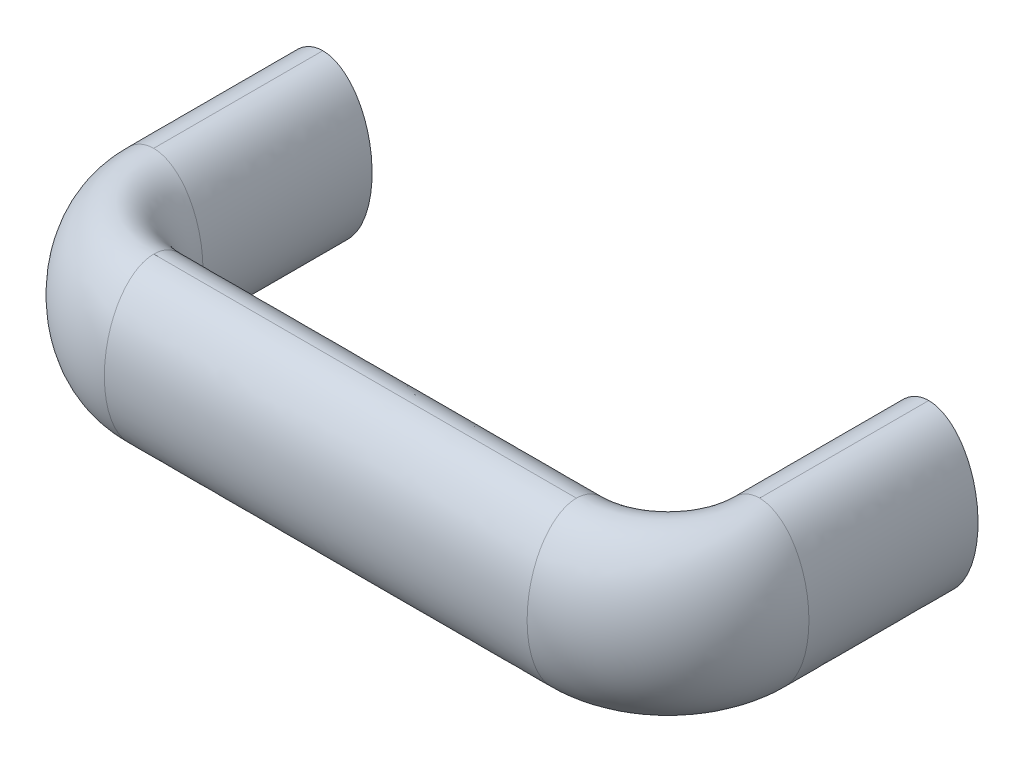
ISO-10303-21;
HEADER;
FILE_DESCRIPTION(('STEP AP214'),'2;1');
FILE_NAME('part.step','',(''),(''),'','','');
FILE_SCHEMA(('AUTOMOTIVE_DESIGN { 1 0 10303 214 1 1 1 1 }'));
ENDSEC;
DATA;
#1=APPLICATION_CONTEXT('core data for automotive mechanical design processes');
#2=APPLICATION_PROTOCOL_DEFINITION('international standard','automotive_design',2000,#1);
#3=PRODUCT_CONTEXT('',#1,'mechanical');
#4=PRODUCT('Part','Part','',(#3));
#5=PRODUCT_RELATED_PRODUCT_CATEGORY('part','',(#4));
#6=PRODUCT_DEFINITION_FORMATION('','',#4);
#7=PRODUCT_DEFINITION_CONTEXT('part definition',#1,'design');
#8=PRODUCT_DEFINITION('design','',#6,#7);
#9=PRODUCT_DEFINITION_SHAPE('','',#8);
#10=(LENGTH_UNIT() NAMED_UNIT(*) SI_UNIT(.MILLI.,.METRE.));
#11=(NAMED_UNIT(*) PLANE_ANGLE_UNIT() SI_UNIT($,.RADIAN.));
#12=(NAMED_UNIT(*) SI_UNIT($,.STERADIAN.) SOLID_ANGLE_UNIT());
#13=UNCERTAINTY_MEASURE_WITH_UNIT(LENGTH_MEASURE(1.E-05),#10,'distance_accuracy_value','');
#14=(GEOMETRIC_REPRESENTATION_CONTEXT(3) GLOBAL_UNCERTAINTY_ASSIGNED_CONTEXT((#13)) GLOBAL_UNIT_ASSIGNED_CONTEXT((#10,
#11,#12)) REPRESENTATION_CONTEXT('',''));
#15=CARTESIAN_POINT('',(0.,0.,0.));
#16=DIRECTION('',(0.,0.,1.));
#17=DIRECTION('',(1.,0.,0.));
#18=AXIS2_PLACEMENT_3D('',#15,#16,#17);
#19=CARTESIAN_POINT('',(82.953553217,-3.036,12.));
#20=DIRECTION('',(0.,0.,-1.));
#21=DIRECTION('',(0.,1.,0.));
#22=AXIS2_PLACEMENT_3D('',#19,#20,#21);
#23=PLANE('',#22);
#24=CARTESIAN_POINT('',(86.,0.,12.));
#25=DIRECTION('',(0.,0.,-1.));
#26=DIRECTION('',(0.,1.,0.));
#27=AXIS2_PLACEMENT_3D('',#24,#25,#26);
#28=CIRCLE('',#27,3.);
#29=CARTESIAN_POINT('',(86.,3.,12.));
#30=VERTEX_POINT('',#29);
#31=EDGE_CURVE('E18',#30,#30,#28,.T.);
#32=ORIENTED_EDGE('',*,*,#31,.T.);
#33=EDGE_LOOP('',(#32));
#34=FACE_BOUND('',#33,.T.);
#35=ADVANCED_FACE('F14',(#34),#23,.T.);
#36=CARTESIAN_POINT('',(86.,0.,12.));
#37=DIRECTION('',(0.,0.,-1.));
#38=DIRECTION('',(0.,1.,0.));
#39=AXIS2_PLACEMENT_3D('',#36,#37,#38);
#40=CYLINDRICAL_SURFACE('',#39,3.);
#41=ORIENTED_EDGE('',*,*,#31,.F.);
#42=EDGE_LOOP('',(#41));
#43=FACE_BOUND('',#42,.T.);
#44=CARTESIAN_POINT('',(86.,0.,0.));
#45=DIRECTION('',(0.,0.,-1.));
#46=DIRECTION('',(0.,1.,0.));
#47=AXIS2_PLACEMENT_3D('',#44,#45,#46);
#48=CIRCLE('',#47,3.);
#49=CARTESIAN_POINT('',(86.,3.,0.));
#50=VERTEX_POINT('',#49);
#51=EDGE_CURVE('E55',#50,#50,#48,.T.);
#52=ORIENTED_EDGE('',*,*,#51,.T.);
#53=EDGE_LOOP('',(#52));
#54=FACE_BOUND('',#53,.T.);
#55=ADVANCED_FACE('F305',(#43,#54),#40,.F.);
#56=CARTESIAN_POINT('',(78.856873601,11.638,0.));
#57=DIRECTION('',(0.,0.,1.));
#58=DIRECTION('',(0.,-1.,0.));
#59=AXIS2_PLACEMENT_3D('',#56,#57,#58);
#60=PLANE('',#59);
#61=ORIENTED_EDGE('',*,*,#51,.F.);
#62=EDGE_LOOP('',(#61));
#63=FACE_BOUND('',#62,.T.);
#64=CARTESIAN_POINT('',(86.,-11.5,0.));
#65=CARTESIAN_POINT('',(85.9351054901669,-11.5000015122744,0.));
#66=CARTESIAN_POINT('',(85.8702202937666,-11.4985170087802,0.));
#67=CARTESIAN_POINT('',(85.7405889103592,-11.4925940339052,0.));
#68=CARTESIAN_POINT('',(85.6758427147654,-11.4881557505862,0.));
#69=CARTESIAN_POINT('',(85.4821151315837,-11.4704493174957,0.));
#70=CARTESIAN_POINT('',(85.3535093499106,-11.452789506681,0.));
#71=CARTESIAN_POINT('',(85.099489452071,-11.4063611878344,0.));
#72=CARTESIAN_POINT('',(84.9740574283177,-11.3776891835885,0.));
#73=CARTESIAN_POINT('',(84.726056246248,-11.3098362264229,0.));
#74=CARTESIAN_POINT('',(84.6034875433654,-11.2706536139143,0.));
#75=CARTESIAN_POINT('',(84.3623261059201,-11.182685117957,0.));
#76=CARTESIAN_POINT('',(84.2437214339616,-11.133931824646,0.));
#77=CARTESIAN_POINT('',(84.0105356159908,-11.0275600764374,0.));
#78=CARTESIAN_POINT('',(83.8959558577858,-10.9699385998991,0.));
#79=CARTESIAN_POINT('',(83.5584536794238,-10.7848457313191,0.));
#80=CARTESIAN_POINT('',(83.3421210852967,-10.6452785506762,0.));
#81=CARTESIAN_POINT('',(82.805492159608,-10.2498914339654,0.));
#82=CARTESIAN_POINT('',(82.4997960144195,-9.97426969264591,0.));
#83=CARTESIAN_POINT('',(82.0767405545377,-9.52804217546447,0.));
#84=CARTESIAN_POINT('',(81.9414500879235,-9.37356190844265,0.));
#85=CARTESIAN_POINT('',(81.6820982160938,-9.05538951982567,0.));
#86=CARTESIAN_POINT('',(81.5580364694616,-8.8916976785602,0.));
#87=CARTESIAN_POINT('',(81.2530223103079,-8.46136533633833,0.));
#88=CARTESIAN_POINT('',(81.0798986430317,-8.18917689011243,0.));
#89=CARTESIAN_POINT('',(80.7578400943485,-7.63081626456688,0.));
#90=CARTESIAN_POINT('',(80.6089188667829,-7.34463630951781,0.));
#91=CARTESIAN_POINT('',(80.3332533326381,-6.76141809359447,0.));
#92=CARTESIAN_POINT('',(80.20653642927,-6.46436695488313,0.));
#93=CARTESIAN_POINT('',(79.973907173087,-5.86232711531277,0.));
#94=CARTESIAN_POINT('',(79.867993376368,-5.55733896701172,0.));
#95=CARTESIAN_POINT('',(79.6273940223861,-4.78690573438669,0.));
#96=CARTESIAN_POINT('',(79.5048832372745,-4.31763335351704,0.));
#97=CARTESIAN_POINT('',(79.3003681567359,-3.37027269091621,0.));
#98=CARTESIAN_POINT('',(79.2183837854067,-2.89218019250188,0.));
#99=CARTESIAN_POINT('',(79.0927829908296,-1.9300589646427,0.));
#100=CARTESIAN_POINT('',(79.049242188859,-1.44602042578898,0.));
#101=CARTESIAN_POINT('',(78.9997341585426,-0.476149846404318,0.));
#102=CARTESIAN_POINT('',(78.9937595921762,0.00968182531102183,0.));
#103=CARTESIAN_POINT('',(79.019544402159,0.992855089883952,0.));
#104=CARTESIAN_POINT('',(79.0522765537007,1.49017193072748,0.));
#105=CARTESIAN_POINT('',(79.157949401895,2.48069630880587,0.));
#106=CARTESIAN_POINT('',(79.2309032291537,2.97390245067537,0.));
#107=CARTESIAN_POINT('',(79.4186937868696,3.95084095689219,0.));
#108=CARTESIAN_POINT('',(79.533396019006,4.43459854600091,0.));
#109=CARTESIAN_POINT('',(79.7391698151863,5.15022437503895,0.));
#110=CARTESIAN_POINT('',(79.8133542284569,5.38702931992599,0.));
#111=CARTESIAN_POINT('',(79.9735434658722,5.85666049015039,0.));
#112=CARTESIAN_POINT('',(80.0595492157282,6.08948640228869,0.));
#113=CARTESIAN_POINT('',(80.2435826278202,6.54912324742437,0.));
#114=CARTESIAN_POINT('',(80.3415538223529,6.77595672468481,0.));
#115=CARTESIAN_POINT('',(80.5505344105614,7.22348981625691,0.));
#116=CARTESIAN_POINT('',(80.6615402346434,7.44419108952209,0.));
#117=CARTESIAN_POINT('',(80.8974331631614,7.87803594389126,0.));
#118=CARTESIAN_POINT('',(81.022318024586,8.09118073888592,0.));
#119=CARTESIAN_POINT('',(81.2869002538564,8.50807984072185,0.));
#120=CARTESIAN_POINT('',(81.4265949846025,8.7118358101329,0.));
#121=CARTESIAN_POINT('',(81.6919607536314,9.06760121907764,0.));
#122=CARTESIAN_POINT('',(81.8147584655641,9.22174506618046,0.));
#123=CARTESIAN_POINT('',(82.0708542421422,9.52099560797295,0.));
#124=CARTESIAN_POINT('',(82.2041528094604,9.66610186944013,0.));
#125=CARTESIAN_POINT('',(82.6202006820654,10.084864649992,0.));
#126=CARTESIAN_POINT('',(82.9196457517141,10.3427161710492,0.));
#127=CARTESIAN_POINT('',(83.4698019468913,10.7302249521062,0.));
#128=CARTESIAN_POINT('',(83.7095108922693,10.8753814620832,0.));
#129=CARTESIAN_POINT('',(84.0838086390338,11.0628126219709,0.));
#130=CARTESIAN_POINT('',(84.2109030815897,11.1201990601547,0.));
#131=CARTESIAN_POINT('',(84.4695509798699,11.2239031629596,0.));
#132=CARTESIAN_POINT('',(84.6011035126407,11.2702231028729,0.));
#133=CARTESIAN_POINT('',(84.836637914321,11.3413545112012,0.));
#134=CARTESIAN_POINT('',(84.9398716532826,11.3686626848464,0.));
#135=CARTESIAN_POINT('',(85.1480188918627,11.415807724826,0.));
#136=CARTESIAN_POINT('',(85.2529320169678,11.4356462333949,0.));
#137=CARTESIAN_POINT('',(85.4645320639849,11.4676385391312,0.));
#138=CARTESIAN_POINT('',(85.5712256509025,11.4797483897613,0.));
#139=CARTESIAN_POINT('',(85.7852760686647,11.4959426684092,0.));
#140=CARTESIAN_POINT('',(85.8926332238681,11.5000227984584,0.));
#141=CARTESIAN_POINT('',(86.,11.5,0.));
#142=B_SPLINE_CURVE_WITH_KNOTS('',3,(#64,#65,#66,#67,#68,#69,#70,#71,#72,#73,#74,#75,#76,#77,
#78,#79,#80,#81,#82,#83,#84,#85,#86,#87,#88,#89,#90,#91,#92,#93,#94,#95,#96,#97,#98,#99,#100,
#101,#102,#103,#104,#105,#106,#107,#108,#109,#110,#111,#112,#113,#114,#115,#116,#117,#118,#119,
#120,#121,#122,#123,#124,#125,#126,#127,#128,#129,#130,#131,#132,#133,#134,#135,#136,#137,#138,
#139,#140,#141),.UNSPECIFIED.,.F.,.F.,(4,2,2,2,2,2,2,2,2,2,2,2,2,2,2,2,2,2,2,2,2,2,2,2,2,2,2,2,
2,2,2,2,2,2,2,2,2,2,4),(0.,0.194648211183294,0.389284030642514,0.778150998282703,
1.16368519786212,1.54928030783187,1.93358447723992,2.31801988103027,3.08800997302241,
4.31549852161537,4.93120446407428,5.54689167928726,6.51314712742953,7.47994581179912,
8.44792938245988,9.415845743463,10.8687502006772,12.3223682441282,13.7788393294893,
15.2350259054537,16.7286007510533,18.2226634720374,19.7119548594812,20.4561603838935,
21.2004242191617,21.941302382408,22.6819781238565,23.4225343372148,24.162958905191,
24.7537128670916,25.3444951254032,26.5233036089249,27.3607138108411,27.7786288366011,
28.196457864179,28.5165594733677,28.83659066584,29.158425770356,29.480433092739),.UNSPECIFIED.);
#143=CARTESIAN_POINT('',(86.,-11.5,0.));
#144=VERTEX_POINT('',#143);
#145=CARTESIAN_POINT('',(86.,11.5,0.));
#146=VERTEX_POINT('',#145);
#147=EDGE_CURVE('E53',#144,#146,#142,.T.);
#148=ORIENTED_EDGE('',*,*,#147,.T.);
#149=CARTESIAN_POINT('',(86.,11.5,0.));
#150=CARTESIAN_POINT('',(86.0648945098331,11.5000015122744,0.));
#151=CARTESIAN_POINT('',(86.1297797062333,11.4985170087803,0.));
#152=CARTESIAN_POINT('',(86.2594110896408,11.4925940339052,0.));
#153=CARTESIAN_POINT('',(86.3241572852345,11.4881557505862,0.));
#154=CARTESIAN_POINT('',(86.5178848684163,11.4704493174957,0.));
#155=CARTESIAN_POINT('',(86.6464906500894,11.452789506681,0.));
#156=CARTESIAN_POINT('',(86.9005105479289,11.4063611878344,0.));
#157=CARTESIAN_POINT('',(87.0259425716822,11.3776891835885,0.));
#158=CARTESIAN_POINT('',(87.2739437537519,11.3098362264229,0.));
#159=CARTESIAN_POINT('',(87.3965124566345,11.2706536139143,0.));
#160=CARTESIAN_POINT('',(87.6376738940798,11.182685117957,0.));
#161=CARTESIAN_POINT('',(87.7562785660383,11.1339318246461,0.));
#162=CARTESIAN_POINT('',(87.9894643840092,11.0275600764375,0.));
#163=CARTESIAN_POINT('',(88.1040441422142,10.9699385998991,0.));
#164=CARTESIAN_POINT('',(88.4415463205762,10.7848457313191,0.));
#165=CARTESIAN_POINT('',(88.6578789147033,10.6452785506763,0.));
#166=CARTESIAN_POINT('',(89.194507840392,10.2498914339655,0.));
#167=CARTESIAN_POINT('',(89.5002039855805,9.97426969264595,0.));
#168=CARTESIAN_POINT('',(89.9232594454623,9.52804217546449,0.));
#169=CARTESIAN_POINT('',(90.0585499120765,9.37356190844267,0.));
#170=CARTESIAN_POINT('',(90.3179017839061,9.05538951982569,0.));
#171=CARTESIAN_POINT('',(90.4419635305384,8.89169767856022,0.));
#172=CARTESIAN_POINT('',(90.7469776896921,8.46136533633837,0.));
#173=CARTESIAN_POINT('',(90.9201013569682,8.18917689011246,0.));
#174=CARTESIAN_POINT('',(91.2421599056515,7.6308162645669,0.));
#175=CARTESIAN_POINT('',(91.3910811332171,7.34463630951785,0.));
#176=CARTESIAN_POINT('',(91.6667466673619,6.76141809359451,0.));
#177=CARTESIAN_POINT('',(91.79346357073,6.46436695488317,0.));
#178=CARTESIAN_POINT('',(92.026092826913,5.86232711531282,0.));
#179=CARTESIAN_POINT('',(92.132006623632,5.55733896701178,0.));
#180=CARTESIAN_POINT('',(92.3726059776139,4.78690573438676,0.));
#181=CARTESIAN_POINT('',(92.4951167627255,4.31763335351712,0.));
#182=CARTESIAN_POINT('',(92.699631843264,3.37027269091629,0.));
#183=CARTESIAN_POINT('',(92.7816162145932,2.89218019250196,0.));
#184=CARTESIAN_POINT('',(92.9072170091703,1.93005896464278,0.));
#185=CARTESIAN_POINT('',(92.950757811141,1.44602042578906,0.));
#186=CARTESIAN_POINT('',(93.0002658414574,0.476149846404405,0.));
#187=CARTESIAN_POINT('',(93.0062404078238,-0.00968182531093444,0.));
#188=CARTESIAN_POINT('',(92.9804555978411,-0.992855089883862,0.));
#189=CARTESIAN_POINT('',(92.9477234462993,-1.49017193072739,0.));
#190=CARTESIAN_POINT('',(92.8420505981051,-2.48069630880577,0.));
#191=CARTESIAN_POINT('',(92.7690967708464,-2.97390245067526,0.));
#192=CARTESIAN_POINT('',(92.5813062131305,-3.95084095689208,0.));
#193=CARTESIAN_POINT('',(92.4666039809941,-4.43459854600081,0.));
#194=CARTESIAN_POINT('',(92.2608301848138,-5.15022437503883,0.));
#195=CARTESIAN_POINT('',(92.1866457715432,-5.38702931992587,0.));
#196=CARTESIAN_POINT('',(92.0264565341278,-5.85666049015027,0.));
#197=CARTESIAN_POINT('',(91.9404507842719,-6.08948640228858,0.));
#198=CARTESIAN_POINT('',(91.7564173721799,-6.54912324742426,0.));
#199=CARTESIAN_POINT('',(91.6584461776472,-6.7759567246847,0.));
#200=CARTESIAN_POINT('',(91.4494655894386,-7.22348981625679,0.));
#201=CARTESIAN_POINT('',(91.3384597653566,-7.44419108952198,0.));
#202=CARTESIAN_POINT('',(91.1025668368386,-7.87803594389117,0.));
#203=CARTESIAN_POINT('',(90.9776819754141,-8.09118073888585,0.));
#204=CARTESIAN_POINT('',(90.7130997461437,-8.50807984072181,0.));
#205=CARTESIAN_POINT('',(90.5734050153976,-8.71183581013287,0.));
#206=CARTESIAN_POINT('',(90.3080392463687,-9.06760121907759,0.));
#207=CARTESIAN_POINT('',(90.185241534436,-9.22174506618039,0.));
#208=CARTESIAN_POINT('',(89.9291457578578,-9.52099560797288,0.));
#209=CARTESIAN_POINT('',(89.7958471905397,-9.66610186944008,0.));
#210=CARTESIAN_POINT('',(89.3797993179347,-10.084864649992,0.));
#211=CARTESIAN_POINT('',(89.0803542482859,-10.3427161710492,0.));
#212=CARTESIAN_POINT('',(88.5301980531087,-10.7302249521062,0.));
#213=CARTESIAN_POINT('',(88.2904891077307,-10.8753814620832,0.));
#214=CARTESIAN_POINT('',(87.9161913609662,-11.0628126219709,0.));
#215=CARTESIAN_POINT('',(87.7890969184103,-11.1201990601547,0.));
#216=CARTESIAN_POINT('',(87.5304490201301,-11.2239031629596,0.));
#217=CARTESIAN_POINT('',(87.3988964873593,-11.2702231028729,0.));
#218=CARTESIAN_POINT('',(87.163362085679,-11.3413545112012,0.));
#219=CARTESIAN_POINT('',(87.0601283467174,-11.3686626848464,0.));
#220=CARTESIAN_POINT('',(86.8519811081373,-11.415807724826,0.));
#221=CARTESIAN_POINT('',(86.7470679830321,-11.4356462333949,0.));
#222=CARTESIAN_POINT('',(86.5354679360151,-11.4676385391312,0.));
#223=CARTESIAN_POINT('',(86.4287743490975,-11.4797483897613,0.));
#224=CARTESIAN_POINT('',(86.2147239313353,-11.4959426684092,0.));
#225=CARTESIAN_POINT('',(86.1073667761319,-11.5000227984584,0.));
#226=CARTESIAN_POINT('',(86.,-11.5,0.));
#227=B_SPLINE_CURVE_WITH_KNOTS('',3,(#149,#150,#151,#152,#153,#154,#155,#156,#157,#158,#159,
#160,#161,#162,#163,#164,#165,#166,#167,#168,#169,#170,#171,#172,#173,#174,#175,#176,#177,#178,
#179,#180,#181,#182,#183,#184,#185,#186,#187,#188,#189,#190,#191,#192,#193,#194,#195,#196,#197,
#198,#199,#200,#201,#202,#203,#204,#205,#206,#207,#208,#209,#210,#211,#212,#213,#214,#215,#216,
#217,#218,#219,#220,#221,#222,#223,#224,#225,#226),.UNSPECIFIED.,.F.,.F.,(4,2,2,2,2,2,2,2,2,2,2,
2,2,2,2,2,2,2,2,2,2,2,2,2,2,2,2,2,2,2,2,2,2,2,2,2,2,2,4),(0.,0.19464821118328,0.389284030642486,
0.778150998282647,1.16368519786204,1.5492803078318,1.93358447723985,2.31801988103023,
3.0880099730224,4.31549852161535,4.93120446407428,5.54689167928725,6.51314712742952,
7.4799458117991,8.44792938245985,9.41584574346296,10.8687502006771,12.3223682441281,
13.7788393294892,15.2350259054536,16.7286007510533,18.2226634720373,19.7119548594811,
20.4561603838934,21.2004242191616,21.9413023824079,22.6819781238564,23.4225343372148,
24.162958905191,24.7537128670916,25.3444951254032,26.5233036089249,27.3607138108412,
27.7786288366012,28.1964578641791,28.5165594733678,28.8365906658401,29.158425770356,
29.4804330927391),.UNSPECIFIED.);
#228=EDGE_CURVE('E45',#146,#144,#227,.T.);
#229=ORIENTED_EDGE('',*,*,#228,.T.);
#230=EDGE_LOOP('',(#148,#229));
#231=FACE_BOUND('',#230,.T.);
#232=ADVANCED_FACE('F52',(#63,#231),#60,.F.);
#233=CARTESIAN_POINT('',(86.,-11.5,24.));
#234=CARTESIAN_POINT('',(86.,-11.5,16.));
#235=CARTESIAN_POINT('',(86.,-11.5,8.));
#236=CARTESIAN_POINT('',(86.,-11.5,0.));
#237=CARTESIAN_POINT('',(100.,-11.5,24.));
#238=CARTESIAN_POINT('',(100.,-11.5,16.));
#239=CARTESIAN_POINT('',(100.,-11.5,8.));
#240=CARTESIAN_POINT('',(100.,-11.5,0.));
#241=CARTESIAN_POINT('',(100.,11.5,24.));
#242=CARTESIAN_POINT('',(100.,11.5,16.));
#243=CARTESIAN_POINT('',(100.,11.5,8.));
#244=CARTESIAN_POINT('',(100.,11.5,0.));
#245=CARTESIAN_POINT('',(86.,11.5,24.));
#246=CARTESIAN_POINT('',(86.,11.5,16.));
#247=CARTESIAN_POINT('',(86.,11.5,8.));
#248=CARTESIAN_POINT('',(86.,11.5,0.));
#249=(BOUNDED_SURFACE() B_SPLINE_SURFACE(3,3,((#233,#234,#235,#236),(#237,#238,#239,#240),(#241,
#242,#243,#244),(#245,#246,#247,#248)),.UNSPECIFIED.,.F.,.F.,
.F.) B_SPLINE_SURFACE_WITH_KNOTS((4,4),(4,4),(0.,1.),(0.,1.),
.UNSPECIFIED.) GEOMETRIC_REPRESENTATION_ITEM() RATIONAL_B_SPLINE_SURFACE(((1.,1.,1.,1.),
(0.333333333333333,0.333333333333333,0.333333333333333,0.333333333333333),(0.333333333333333,
0.333333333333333,0.333333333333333,0.333333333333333),(1.,1.,1.,1.))) REPRESENTATION_ITEM('') SURFACE());
#250=CARTESIAN_POINT('',(86.,-11.5,24.));
#251=CARTESIAN_POINT('',(100.,-11.5,24.));
#252=CARTESIAN_POINT('',(100.,11.5,24.));
#253=CARTESIAN_POINT('',(86.,11.5,24.));
#254=CARTESIAN_POINT('',(72.0000000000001,11.5,24.));
#255=CARTESIAN_POINT('',(72.0000000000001,-11.5,24.));
#256=CARTESIAN_POINT('',(86.,-11.5,24.));
#257=(BOUNDED_CURVE() B_SPLINE_CURVE(3,(#250,#251,#252,#253,#254,#255,#256),.UNSPECIFIED.,.T.,
.F.) B_SPLINE_CURVE_WITH_KNOTS((4,3,4),(0.,0.5,1.),
.UNSPECIFIED.) CURVE() GEOMETRIC_REPRESENTATION_ITEM() RATIONAL_B_SPLINE_CURVE((1.,
0.333333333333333,0.333333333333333,1.,0.333333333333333,0.333333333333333,1.)) REPRESENTATION_ITEM(''));
#258=CARTESIAN_POINT('',(86.,-11.5,24.));
#259=VERTEX_POINT('',#258);
#260=CARTESIAN_POINT('',(86.,11.5,24.));
#261=VERTEX_POINT('',#260);
#262=EDGE_CURVE('E66',#259,#261,#257,.T.);
#263=DIRECTION('',(0.,0.,-1.));
#264=VECTOR('',#263,1.);
#265=CARTESIAN_POINT('',(86.,-11.5,12.));
#266=LINE('',#265,#264);
#267=EDGE_CURVE('E54',#259,#144,#266,.T.);
#268=DIRECTION('',(0.,0.,1.));
#269=VECTOR('',#268,1.);
#270=CARTESIAN_POINT('',(86.,11.5,12.));
#271=LINE('',#270,#269);
#272=EDGE_CURVE('E61',#146,#261,#271,.T.);
#273=ORIENTED_EDGE('',*,*,#262,.F.);
#274=ORIENTED_EDGE('',*,*,#267,.T.);
#275=ORIENTED_EDGE('',*,*,#228,.F.);
#276=ORIENTED_EDGE('',*,*,#272,.T.);
#277=EDGE_LOOP('',(#273,#274,#275,#276));
#278=FACE_BOUND('',#277,.T.);
#279=ADVANCED_FACE('F64',(#278),#249,.F.);
#280=CARTESIAN_POINT('',(86.,11.5,24.));
#281=CARTESIAN_POINT('',(86.,11.5,16.));
#282=CARTESIAN_POINT('',(86.,11.5,8.));
#283=CARTESIAN_POINT('',(86.,11.5,0.));
#284=CARTESIAN_POINT('',(72.0000000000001,11.5,24.));
#285=CARTESIAN_POINT('',(72.0000000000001,11.5,16.));
#286=CARTESIAN_POINT('',(72.0000000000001,11.5,8.));
#287=CARTESIAN_POINT('',(72.0000000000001,11.5,0.));
#288=CARTESIAN_POINT('',(72.0000000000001,-11.5,24.));
#289=CARTESIAN_POINT('',(72.0000000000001,-11.5,16.));
#290=CARTESIAN_POINT('',(72.0000000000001,-11.5,8.));
#291=CARTESIAN_POINT('',(72.0000000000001,-11.5,0.));
#292=CARTESIAN_POINT('',(86.,-11.5,24.));
#293=CARTESIAN_POINT('',(86.,-11.5,16.));
#294=CARTESIAN_POINT('',(86.,-11.5,8.));
#295=CARTESIAN_POINT('',(86.,-11.5,0.));
#296=(BOUNDED_SURFACE() B_SPLINE_SURFACE(3,3,((#280,#281,#282,#283),(#284,#285,#286,#287),(#288,
#289,#290,#291),(#292,#293,#294,#295)),.UNSPECIFIED.,.F.,.F.,
.F.) B_SPLINE_SURFACE_WITH_KNOTS((4,4),(4,4),(0.,1.),(0.,1.),
.UNSPECIFIED.) GEOMETRIC_REPRESENTATION_ITEM() RATIONAL_B_SPLINE_SURFACE(((1.,1.,1.,1.),
(0.333333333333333,0.333333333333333,0.333333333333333,0.333333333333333),(0.333333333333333,
0.333333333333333,0.333333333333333,0.333333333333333),(1.,1.,1.,1.))) REPRESENTATION_ITEM('') SURFACE());
#297=CARTESIAN_POINT('',(86.,-11.5,24.));
#298=CARTESIAN_POINT('',(100.,-11.5,24.));
#299=CARTESIAN_POINT('',(100.,11.5,24.));
#300=CARTESIAN_POINT('',(86.,11.5,24.));
#301=CARTESIAN_POINT('',(72.0000000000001,11.5,24.));
#302=CARTESIAN_POINT('',(72.0000000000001,-11.5,24.));
#303=CARTESIAN_POINT('',(86.,-11.5,24.));
#304=(BOUNDED_CURVE() B_SPLINE_CURVE(3,(#297,#298,#299,#300,#301,#302,#303),.UNSPECIFIED.,.T.,
.F.) B_SPLINE_CURVE_WITH_KNOTS((4,3,4),(0.,0.5,1.),
.UNSPECIFIED.) CURVE() GEOMETRIC_REPRESENTATION_ITEM() RATIONAL_B_SPLINE_CURVE((1.,
0.333333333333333,0.333333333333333,1.,0.333333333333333,0.333333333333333,1.)) REPRESENTATION_ITEM(''));
#305=EDGE_CURVE('E128',#261,#259,#304,.T.);
#306=ORIENTED_EDGE('',*,*,#272,.F.);
#307=ORIENTED_EDGE('',*,*,#147,.F.);
#308=ORIENTED_EDGE('',*,*,#267,.F.);
#309=ORIENTED_EDGE('',*,*,#305,.F.);
#310=EDGE_LOOP('',(#306,#307,#308,#309));
#311=FACE_BOUND('',#310,.T.);
#312=ADVANCED_FACE('F58',(#311),#296,.F.);
#313=CARTESIAN_POINT('',(86.,-11.5,24.));
#314=CARTESIAN_POINT('',(86.,-11.5,31.615223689));
#315=CARTESIAN_POINT('',(80.6152236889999,-11.5,37.));
#316=CARTESIAN_POINT('',(73.,-11.5,37.));
#317=CARTESIAN_POINT('',(100.,-11.5,24.));
#318=CARTESIAN_POINT('',(100.,-11.5,39.816233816));
#319=CARTESIAN_POINT('',(88.8162338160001,-11.5,51.));
#320=CARTESIAN_POINT('',(73.,-11.5,51.0000000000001));
#321=CARTESIAN_POINT('',(100.,11.5,24.));
#322=CARTESIAN_POINT('',(100.,11.5,39.816233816));
#323=CARTESIAN_POINT('',(88.8162338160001,11.5,51.));
#324=CARTESIAN_POINT('',(73.,11.5,51.0000000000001));
#325=CARTESIAN_POINT('',(86.,11.5,24.));
#326=CARTESIAN_POINT('',(86.,11.5,31.615223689));
#327=CARTESIAN_POINT('',(80.6152236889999,11.5,37.));
#328=CARTESIAN_POINT('',(73.,11.5,37.));
#329=CARTESIAN_POINT('',(72.0000000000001,11.5,24.));
#330=CARTESIAN_POINT('',(72.0000000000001,11.5,23.414213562));
#331=CARTESIAN_POINT('',(72.414213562,11.5,23.));
#332=CARTESIAN_POINT('',(73.,11.5,23.));
#333=CARTESIAN_POINT('',(72.0000000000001,-11.5,24.));
#334=CARTESIAN_POINT('',(72.0000000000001,-11.5,23.414213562));
#335=CARTESIAN_POINT('',(72.414213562,-11.5,23.));
#336=CARTESIAN_POINT('',(73.,-11.5,23.));
#337=CARTESIAN_POINT('',(86.,-11.5,24.));
#338=CARTESIAN_POINT('',(86.,-11.5,31.615223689));
#339=CARTESIAN_POINT('',(80.6152236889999,-11.5,37.));
#340=CARTESIAN_POINT('',(73.,-11.5,37.));
#341=(BOUNDED_SURFACE() B_SPLINE_SURFACE(3,3,((#313,#314,#315,#316),(#317,#318,#319,#320),(#321,
#322,#323,#324),(#325,#326,#327,#328),(#329,#330,#331,#332),(#333,#334,#335,#336),(#337,#338,
#339,#340)),.UNSPECIFIED.,.T.,.F.,.F.) B_SPLINE_SURFACE_WITH_KNOTS((4,3,4),(4,4),(0.,0.5,1.),
(0.,1.),.UNSPECIFIED.) GEOMETRIC_REPRESENTATION_ITEM() RATIONAL_B_SPLINE_SURFACE(((1.,
0.804737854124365,0.804737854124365,1.),(0.333333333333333,0.268245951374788,0.268245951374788,
0.333333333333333),(0.333333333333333,0.268245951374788,0.268245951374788,0.333333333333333),
(1.,0.804737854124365,0.804737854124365,1.),(0.333333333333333,0.268245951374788,
0.268245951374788,0.333333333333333),(0.333333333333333,0.268245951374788,0.268245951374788,
0.333333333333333),(1.,0.804737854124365,0.804737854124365,1.))) REPRESENTATION_ITEM('') SURFACE());
#342=CARTESIAN_POINT('',(73.,-11.5,37.));
#343=CARTESIAN_POINT('',(73.,-11.5,51.0000000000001));
#344=CARTESIAN_POINT('',(73.,11.5,51.0000000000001));
#345=CARTESIAN_POINT('',(73.,11.5,37.));
#346=(BOUNDED_CURVE() B_SPLINE_CURVE(3,(#342,#343,#344,#345),.UNSPECIFIED.,.F.,
.F.) B_SPLINE_CURVE_WITH_KNOTS((4,4),(0.,1.),
.UNSPECIFIED.) CURVE() GEOMETRIC_REPRESENTATION_ITEM() RATIONAL_B_SPLINE_CURVE((1.,
0.333333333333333,0.333333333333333,1.)) REPRESENTATION_ITEM(''));
#347=CARTESIAN_POINT('',(73.,-11.5,37.));
#348=VERTEX_POINT('',#347);
#349=CARTESIAN_POINT('',(73.,11.5,37.));
#350=VERTEX_POINT('',#349);
#351=EDGE_CURVE('E145',#348,#350,#346,.T.);
#352=CARTESIAN_POINT('',(73.,11.5,37.));
#353=CARTESIAN_POINT('',(73.,11.5,23.));
#354=CARTESIAN_POINT('',(73.,-11.5,23.));
#355=CARTESIAN_POINT('',(73.,-11.5,37.));
#356=(BOUNDED_CURVE() B_SPLINE_CURVE(3,(#352,#353,#354,#355),.UNSPECIFIED.,.F.,
.F.) B_SPLINE_CURVE_WITH_KNOTS((4,4),(0.,1.),
.UNSPECIFIED.) CURVE() GEOMETRIC_REPRESENTATION_ITEM() RATIONAL_B_SPLINE_CURVE((1.,
0.333333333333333,0.333333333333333,1.)) REPRESENTATION_ITEM(''));
#357=EDGE_CURVE('E153',#350,#348,#356,.T.);
#358=ORIENTED_EDGE('',*,*,#305,.T.);
#359=ORIENTED_EDGE('',*,*,#262,.T.);
#360=EDGE_LOOP('',(#358,#359));
#361=FACE_BOUND('',#360,.T.);
#362=ORIENTED_EDGE('',*,*,#351,.F.);
#363=ORIENTED_EDGE('',*,*,#357,.F.);
#364=EDGE_LOOP('',(#362,#363));
#365=FACE_BOUND('',#364,.T.);
#366=ADVANCED_FACE('F81',(#361,#365),#341,.T.);
#367=CARTESIAN_POINT('',(73.,-11.5,37.));
#368=CARTESIAN_POINT('',(53.,-11.5,37.));
#369=CARTESIAN_POINT('',(33.,-11.5,37.));
#370=CARTESIAN_POINT('',(13.,-11.5,37.));
#371=CARTESIAN_POINT('',(73.,-11.5,51.0000000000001));
#372=CARTESIAN_POINT('',(53.,-11.5,51.0000000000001));
#373=CARTESIAN_POINT('',(33.,-11.5,51.0000000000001));
#374=CARTESIAN_POINT('',(13.,-11.5,51.0000000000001));
#375=CARTESIAN_POINT('',(73.,11.5,51.0000000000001));
#376=CARTESIAN_POINT('',(53.,11.5,51.0000000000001));
#377=CARTESIAN_POINT('',(33.,11.5,51.0000000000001));
#378=CARTESIAN_POINT('',(13.,11.5,51.0000000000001));
#379=CARTESIAN_POINT('',(73.,11.5,37.));
#380=CARTESIAN_POINT('',(53.,11.5,37.));
#381=CARTESIAN_POINT('',(33.,11.5,37.));
#382=CARTESIAN_POINT('',(13.,11.5,37.));
#383=(BOUNDED_SURFACE() B_SPLINE_SURFACE(3,3,((#367,#368,#369,#370),(#371,#372,#373,#374),(#375,
#376,#377,#378),(#379,#380,#381,#382)),.UNSPECIFIED.,.F.,.F.,
.F.) B_SPLINE_SURFACE_WITH_KNOTS((4,4),(4,4),(0.,1.),(0.,1.),
.UNSPECIFIED.) GEOMETRIC_REPRESENTATION_ITEM() RATIONAL_B_SPLINE_SURFACE(((1.,1.,1.,1.),
(0.333333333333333,0.333333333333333,0.333333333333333,0.333333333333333),(0.333333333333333,
0.333333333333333,0.333333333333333,0.333333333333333),(1.,1.,1.,1.))) REPRESENTATION_ITEM('') SURFACE());
#384=CARTESIAN_POINT('',(13.,-11.5,37.));
#385=CARTESIAN_POINT('',(13.,-11.5,51.0000000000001));
#386=CARTESIAN_POINT('',(13.,11.5,51.0000000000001));
#387=CARTESIAN_POINT('',(13.,11.5,37.));
#388=CARTESIAN_POINT('',(13.,11.5,23.));
#389=CARTESIAN_POINT('',(13.,-11.5,23.));
#390=CARTESIAN_POINT('',(13.,-11.5,37.));
#391=(BOUNDED_CURVE() B_SPLINE_CURVE(3,(#384,#385,#386,#387,#388,#389,#390),.UNSPECIFIED.,.T.,
.F.) B_SPLINE_CURVE_WITH_KNOTS((4,3,4),(0.,0.5,1.),
.UNSPECIFIED.) CURVE() GEOMETRIC_REPRESENTATION_ITEM() RATIONAL_B_SPLINE_CURVE((1.,
0.333333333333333,0.333333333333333,1.,0.333333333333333,0.333333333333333,1.)) REPRESENTATION_ITEM(''));
#392=CARTESIAN_POINT('',(13.,-11.5,37.));
#393=VERTEX_POINT('',#392);
#394=CARTESIAN_POINT('',(13.,11.5,37.));
#395=VERTEX_POINT('',#394);
#396=EDGE_CURVE('E172',#393,#395,#391,.T.);
#397=DIRECTION('',(-1.,0.,0.));
#398=VECTOR('',#397,1.);
#399=CARTESIAN_POINT('',(43.,-11.5,37.));
#400=LINE('',#399,#398);
#401=EDGE_CURVE('E159',#348,#393,#400,.T.);
#402=DIRECTION('',(1.,0.,0.));
#403=VECTOR('',#402,1.);
#404=CARTESIAN_POINT('',(43.,11.5,37.));
#405=LINE('',#404,#403);
#406=EDGE_CURVE('E147',#395,#350,#405,.T.);
#407=ORIENTED_EDGE('',*,*,#396,.F.);
#408=ORIENTED_EDGE('',*,*,#401,.F.);
#409=ORIENTED_EDGE('',*,*,#351,.T.);
#410=ORIENTED_EDGE('',*,*,#406,.F.);
#411=EDGE_LOOP('',(#407,#408,#409,#410));
#412=FACE_BOUND('',#411,.T.);
#413=ADVANCED_FACE('F93',(#412),#383,.T.);
#414=CARTESIAN_POINT('',(73.,11.5,37.));
#415=CARTESIAN_POINT('',(53.,11.5,37.));
#416=CARTESIAN_POINT('',(33.,11.5,37.));
#417=CARTESIAN_POINT('',(13.,11.5,37.));
#418=CARTESIAN_POINT('',(73.,11.5,23.));
#419=CARTESIAN_POINT('',(53.,11.5,23.));
#420=CARTESIAN_POINT('',(33.,11.5,23.));
#421=CARTESIAN_POINT('',(13.,11.5,23.));
#422=CARTESIAN_POINT('',(73.,-11.5,23.));
#423=CARTESIAN_POINT('',(53.,-11.5,23.));
#424=CARTESIAN_POINT('',(33.,-11.5,23.));
#425=CARTESIAN_POINT('',(13.,-11.5,23.));
#426=CARTESIAN_POINT('',(73.,-11.5,37.));
#427=CARTESIAN_POINT('',(53.,-11.5,37.));
#428=CARTESIAN_POINT('',(33.,-11.5,37.));
#429=CARTESIAN_POINT('',(13.,-11.5,37.));
#430=(BOUNDED_SURFACE() B_SPLINE_SURFACE(3,3,((#414,#415,#416,#417),(#418,#419,#420,#421),(#422,
#423,#424,#425),(#426,#427,#428,#429)),.UNSPECIFIED.,.F.,.F.,
.F.) B_SPLINE_SURFACE_WITH_KNOTS((4,4),(4,4),(0.,1.),(0.,1.),
.UNSPECIFIED.) GEOMETRIC_REPRESENTATION_ITEM() RATIONAL_B_SPLINE_SURFACE(((1.,1.,1.,1.),
(0.333333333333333,0.333333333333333,0.333333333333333,0.333333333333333),(0.333333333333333,
0.333333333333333,0.333333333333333,0.333333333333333),(1.,1.,1.,1.))) REPRESENTATION_ITEM('') SURFACE());
#431=CARTESIAN_POINT('',(13.,-11.5,37.));
#432=CARTESIAN_POINT('',(13.,-11.5,51.0000000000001));
#433=CARTESIAN_POINT('',(13.,11.5,51.0000000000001));
#434=CARTESIAN_POINT('',(13.,11.5,37.));
#435=CARTESIAN_POINT('',(13.,11.5,23.));
#436=CARTESIAN_POINT('',(13.,-11.5,23.));
#437=CARTESIAN_POINT('',(13.,-11.5,37.));
#438=(BOUNDED_CURVE() B_SPLINE_CURVE(3,(#431,#432,#433,#434,#435,#436,#437),.UNSPECIFIED.,.T.,
.F.) B_SPLINE_CURVE_WITH_KNOTS((4,3,4),(0.,0.5,1.),
.UNSPECIFIED.) CURVE() GEOMETRIC_REPRESENTATION_ITEM() RATIONAL_B_SPLINE_CURVE((1.,
0.333333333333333,0.333333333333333,1.,0.333333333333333,0.333333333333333,1.)) REPRESENTATION_ITEM(''));
#439=EDGE_CURVE('E225',#395,#393,#438,.T.);
#440=ORIENTED_EDGE('',*,*,#401,.T.);
#441=ORIENTED_EDGE('',*,*,#439,.F.);
#442=ORIENTED_EDGE('',*,*,#406,.T.);
#443=ORIENTED_EDGE('',*,*,#357,.T.);
#444=EDGE_LOOP('',(#440,#441,#442,#443));
#445=FACE_BOUND('',#444,.T.);
#446=ADVANCED_FACE('F190',(#445),#430,.T.);
#447=CARTESIAN_POINT('',(13.,-11.5,37.));
#448=CARTESIAN_POINT('',(5.384776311,-11.5,37.));
#449=CARTESIAN_POINT('',(0.,-11.5,31.615223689));
#450=CARTESIAN_POINT('',(0.,-11.5,24.));
#451=CARTESIAN_POINT('',(13.,-11.5,51.0000000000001));
#452=CARTESIAN_POINT('',(-2.816233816,-11.5,51.));
#453=CARTESIAN_POINT('',(-14.,-11.5,39.816233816));
#454=CARTESIAN_POINT('',(-14.,-11.5,24.));
#455=CARTESIAN_POINT('',(13.,11.5,51.0000000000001));
#456=CARTESIAN_POINT('',(-2.816233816,11.5,51.));
#457=CARTESIAN_POINT('',(-14.,11.5,39.816233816));
#458=CARTESIAN_POINT('',(-14.,11.5,24.));
#459=CARTESIAN_POINT('',(13.,11.5,37.));
#460=CARTESIAN_POINT('',(5.384776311,11.5,37.));
#461=CARTESIAN_POINT('',(0.,11.5,31.615223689));
#462=CARTESIAN_POINT('',(0.,11.5,24.));
#463=CARTESIAN_POINT('',(13.,11.5,23.));
#464=CARTESIAN_POINT('',(13.585786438,11.5,23.));
#465=CARTESIAN_POINT('',(14.,11.5,23.414213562));
#466=CARTESIAN_POINT('',(14.,11.5,24.));
#467=CARTESIAN_POINT('',(13.,-11.5,23.));
#468=CARTESIAN_POINT('',(13.585786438,-11.5,23.));
#469=CARTESIAN_POINT('',(14.,-11.5,23.414213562));
#470=CARTESIAN_POINT('',(14.,-11.5,24.));
#471=CARTESIAN_POINT('',(13.,-11.5,37.));
#472=CARTESIAN_POINT('',(5.384776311,-11.5,37.));
#473=CARTESIAN_POINT('',(0.,-11.5,31.615223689));
#474=CARTESIAN_POINT('',(0.,-11.5,24.));
#475=(BOUNDED_SURFACE() B_SPLINE_SURFACE(3,3,((#447,#448,#449,#450),(#451,#452,#453,#454),(#455,
#456,#457,#458),(#459,#460,#461,#462),(#463,#464,#465,#466),(#467,#468,#469,#470),(#471,#472,
#473,#474)),.UNSPECIFIED.,.T.,.F.,.F.) B_SPLINE_SURFACE_WITH_KNOTS((4,3,4),(4,4),(0.,0.5,1.),
(0.,1.),.UNSPECIFIED.) GEOMETRIC_REPRESENTATION_ITEM() RATIONAL_B_SPLINE_SURFACE(((1.,
0.804737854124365,0.804737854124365,1.),(0.333333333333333,0.268245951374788,0.268245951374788,
0.333333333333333),(0.333333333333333,0.268245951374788,0.268245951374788,0.333333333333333),
(1.,0.804737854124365,0.804737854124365,1.),(0.333333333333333,0.268245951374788,
0.268245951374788,0.333333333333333),(0.333333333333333,0.268245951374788,0.268245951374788,
0.333333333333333),(1.,0.804737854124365,0.804737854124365,1.))) REPRESENTATION_ITEM('') SURFACE());
#476=CARTESIAN_POINT('',(0.,-11.5,24.));
#477=CARTESIAN_POINT('',(-14.,-11.5,24.));
#478=CARTESIAN_POINT('',(-14.,11.5,24.));
#479=CARTESIAN_POINT('',(0.,11.5,24.));
#480=(BOUNDED_CURVE() B_SPLINE_CURVE(3,(#476,#477,#478,#479),.UNSPECIFIED.,.F.,
.F.) B_SPLINE_CURVE_WITH_KNOTS((4,4),(0.,1.),
.UNSPECIFIED.) CURVE() GEOMETRIC_REPRESENTATION_ITEM() RATIONAL_B_SPLINE_CURVE((1.,
0.333333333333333,0.333333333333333,1.)) REPRESENTATION_ITEM(''));
#481=CARTESIAN_POINT('',(0.,-11.5,24.));
#482=VERTEX_POINT('',#481);
#483=CARTESIAN_POINT('',(0.,11.5,24.));
#484=VERTEX_POINT('',#483);
#485=EDGE_CURVE('E243',#482,#484,#480,.T.);
#486=CARTESIAN_POINT('',(0.,11.5,24.));
#487=CARTESIAN_POINT('',(14.,11.5,24.));
#488=CARTESIAN_POINT('',(14.,-11.5,24.));
#489=CARTESIAN_POINT('',(0.,-11.5,24.));
#490=(BOUNDED_CURVE() B_SPLINE_CURVE(3,(#486,#487,#488,#489),.UNSPECIFIED.,.F.,
.F.) B_SPLINE_CURVE_WITH_KNOTS((4,4),(0.,1.),
.UNSPECIFIED.) CURVE() GEOMETRIC_REPRESENTATION_ITEM() RATIONAL_B_SPLINE_CURVE((1.,
0.333333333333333,0.333333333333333,1.)) REPRESENTATION_ITEM(''));
#491=EDGE_CURVE('E250',#484,#482,#490,.T.);
#492=ORIENTED_EDGE('',*,*,#439,.T.);
#493=ORIENTED_EDGE('',*,*,#396,.T.);
#494=EDGE_LOOP('',(#492,#493));
#495=FACE_BOUND('',#494,.T.);
#496=ORIENTED_EDGE('',*,*,#485,.F.);
#497=ORIENTED_EDGE('',*,*,#491,.F.);
#498=EDGE_LOOP('',(#496,#497));
#499=FACE_BOUND('',#498,.T.);
#500=ADVANCED_FACE('F178',(#495,#499),#475,.T.);
#501=CARTESIAN_POINT('',(0.,-11.5,24.));
#502=CARTESIAN_POINT('',(0.,-11.5,16.));
#503=CARTESIAN_POINT('',(0.,-11.5,8.));
#504=CARTESIAN_POINT('',(0.,-11.5,0.));
#505=CARTESIAN_POINT('',(-14.,-11.5,24.));
#506=CARTESIAN_POINT('',(-14.,-11.5,16.));
#507=CARTESIAN_POINT('',(-14.,-11.5,8.));
#508=CARTESIAN_POINT('',(-14.,-11.5,0.));
#509=CARTESIAN_POINT('',(-14.,11.5,24.));
#510=CARTESIAN_POINT('',(-14.,11.5,16.));
#511=CARTESIAN_POINT('',(-14.,11.5,8.));
#512=CARTESIAN_POINT('',(-14.,11.5,0.));
#513=CARTESIAN_POINT('',(0.,11.5,24.));
#514=CARTESIAN_POINT('',(0.,11.5,16.));
#515=CARTESIAN_POINT('',(0.,11.5,8.));
#516=CARTESIAN_POINT('',(0.,11.5,0.));
#517=(BOUNDED_SURFACE() B_SPLINE_SURFACE(3,3,((#501,#502,#503,#504),(#505,#506,#507,#508),(#509,
#510,#511,#512),(#513,#514,#515,#516)),.UNSPECIFIED.,.F.,.F.,
.F.) B_SPLINE_SURFACE_WITH_KNOTS((4,4),(4,4),(0.,1.),(0.,1.),
.UNSPECIFIED.) GEOMETRIC_REPRESENTATION_ITEM() RATIONAL_B_SPLINE_SURFACE(((1.,1.,1.,1.),
(0.333333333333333,0.333333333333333,0.333333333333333,0.333333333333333),(0.333333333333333,
0.333333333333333,0.333333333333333,0.333333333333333),(1.,1.,1.,1.))) REPRESENTATION_ITEM('') SURFACE());
#518=CARTESIAN_POINT('',(0.,-11.5,0.));
#519=CARTESIAN_POINT('',(-0.0648945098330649,-11.5000015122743,0.));
#520=CARTESIAN_POINT('',(-0.129779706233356,-11.4985170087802,0.));
#521=CARTESIAN_POINT('',(-0.259411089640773,-11.4925940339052,0.));
#522=CARTESIAN_POINT('',(-0.324157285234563,-11.4881557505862,0.));
#523=CARTESIAN_POINT('',(-0.517884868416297,-11.4704493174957,0.));
#524=CARTESIAN_POINT('',(-0.646490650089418,-11.452789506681,0.));
#525=CARTESIAN_POINT('',(-0.900510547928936,-11.4063611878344,0.));
#526=CARTESIAN_POINT('',(-1.02594257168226,-11.3776891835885,0.));
#527=CARTESIAN_POINT('',(-1.27394375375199,-11.3098362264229,0.));
#528=CARTESIAN_POINT('',(-1.3965124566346,-11.2706536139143,0.));
#529=CARTESIAN_POINT('',(-1.63767389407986,-11.182685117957,0.));
#530=CARTESIAN_POINT('',(-1.75627856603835,-11.133931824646,0.));
#531=CARTESIAN_POINT('',(-1.98946438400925,-11.0275600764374,0.));
#532=CARTESIAN_POINT('',(-2.10404414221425,-10.9699385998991,0.));
#533=CARTESIAN_POINT('',(-2.44154632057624,-10.7848457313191,0.));
#534=CARTESIAN_POINT('',(-2.65787891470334,-10.6452785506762,0.));
#535=CARTESIAN_POINT('',(-3.19450784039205,-10.2498914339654,0.));
#536=CARTESIAN_POINT('',(-3.50020398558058,-9.9742696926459,0.));
#537=CARTESIAN_POINT('',(-3.92325944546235,-9.52804217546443,0.));
#538=CARTESIAN_POINT('',(-4.05854991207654,-9.37356190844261,0.));
#539=CARTESIAN_POINT('',(-4.3179017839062,-9.05538951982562,0.));
#540=CARTESIAN_POINT('',(-4.44196353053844,-8.89169767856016,0.));
#541=CARTESIAN_POINT('',(-4.74697768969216,-8.4613653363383,0.));
#542=CARTESIAN_POINT('',(-4.92010135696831,-8.18917689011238,0.));
#543=CARTESIAN_POINT('',(-5.24215990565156,-7.63081626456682,0.));
#544=CARTESIAN_POINT('',(-5.39108113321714,-7.34463630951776,0.));
#545=CARTESIAN_POINT('',(-5.66674666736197,-6.76141809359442,0.));
#546=CARTESIAN_POINT('',(-5.79346357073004,-6.46436695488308,0.));
#547=CARTESIAN_POINT('',(-6.02609282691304,-5.86232711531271,0.));
#548=CARTESIAN_POINT('',(-6.13200662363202,-5.55733896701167,0.));
#549=CARTESIAN_POINT('',(-6.37260597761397,-4.78690573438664,0.));
#550=CARTESIAN_POINT('',(-6.49511676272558,-4.31763335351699,0.));
#551=CARTESIAN_POINT('',(-6.6996318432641,-3.37027269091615,0.));
#552=CARTESIAN_POINT('',(-6.78161621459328,-2.89218019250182,0.));
#553=CARTESIAN_POINT('',(-6.90721700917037,-1.93005896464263,0.));
#554=CARTESIAN_POINT('',(-6.95075781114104,-1.44602042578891,0.));
#555=CARTESIAN_POINT('',(-7.00026584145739,-0.476149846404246,0.));
#556=CARTESIAN_POINT('',(-7.00624040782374,0.00968182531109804,0.));
#557=CARTESIAN_POINT('',(-6.98045559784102,0.992855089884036,0.));
#558=CARTESIAN_POINT('',(-6.94772344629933,1.49017193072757,0.));
#559=CARTESIAN_POINT('',(-6.84205059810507,2.48069630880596,0.));
#560=CARTESIAN_POINT('',(-6.76909677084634,2.97390245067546,0.));
#561=CARTESIAN_POINT('',(-6.58130621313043,3.95084095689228,0.));
#562=CARTESIAN_POINT('',(-6.466603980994,4.43459854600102,0.));
#563=CARTESIAN_POINT('',(-6.26083018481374,5.15022437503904,0.));
#564=CARTESIAN_POINT('',(-6.18664577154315,5.38702931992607,0.));
#565=CARTESIAN_POINT('',(-6.02645653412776,5.85666049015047,0.));
#566=CARTESIAN_POINT('',(-5.94045078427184,6.08948640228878,0.));
#567=CARTESIAN_POINT('',(-5.75641737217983,6.54912324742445,0.));
#568=CARTESIAN_POINT('',(-5.65844617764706,6.77595672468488,0.));
#569=CARTESIAN_POINT('',(-5.44946558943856,7.22348981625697,0.));
#570=CARTESIAN_POINT('',(-5.33845976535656,7.44419108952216,0.));
#571=CARTESIAN_POINT('',(-5.10256683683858,7.87803594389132,0.));
#572=CARTESIAN_POINT('',(-4.977681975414,8.09118073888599,0.));
#573=CARTESIAN_POINT('',(-4.71309974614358,8.50807984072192,0.));
#574=CARTESIAN_POINT('',(-4.57340501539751,8.71183581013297,0.));
#575=CARTESIAN_POINT('',(-4.30803924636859,9.06760121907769,0.));
#576=CARTESIAN_POINT('',(-4.18524153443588,9.2217450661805,0.));
#577=CARTESIAN_POINT('',(-3.92914575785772,9.52099560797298,0.));
#578=CARTESIAN_POINT('',(-3.79584719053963,9.66610186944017,0.));
#579=CARTESIAN_POINT('',(-3.37979931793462,10.084864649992,0.));
#580=CARTESIAN_POINT('',(-3.08035424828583,10.3427161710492,0.));
#581=CARTESIAN_POINT('',(-2.53019805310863,10.7302249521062,0.));
#582=CARTESIAN_POINT('',(-2.29048910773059,10.8753814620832,0.));
#583=CARTESIAN_POINT('',(-1.91619136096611,11.0628126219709,0.));
#584=CARTESIAN_POINT('',(-1.78909691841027,11.1201990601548,0.));
#585=CARTESIAN_POINT('',(-1.53044902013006,11.2239031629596,0.));
#586=CARTESIAN_POINT('',(-1.39889648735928,11.2702231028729,0.));
#587=CARTESIAN_POINT('',(-1.16336208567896,11.3413545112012,0.));
#588=CARTESIAN_POINT('',(-1.06012834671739,11.3686626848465,0.));
#589=CARTESIAN_POINT('',(-0.851981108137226,11.4158077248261,0.));
#590=CARTESIAN_POINT('',(-0.747067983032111,11.4356462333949,0.));
#591=CARTESIAN_POINT('',(-0.535467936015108,11.4676385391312,0.));
#592=CARTESIAN_POINT('',(-0.428774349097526,11.4797483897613,0.));
#593=CARTESIAN_POINT('',(-0.214723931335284,11.4959426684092,0.));
#594=CARTESIAN_POINT('',(-0.107366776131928,11.5000227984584,0.));
#595=CARTESIAN_POINT('',(0.,11.5,0.));
#596=B_SPLINE_CURVE_WITH_KNOTS('',3,(#518,#519,#520,#521,#522,#523,#524,#525,#526,#527,#528,
#529,#530,#531,#532,#533,#534,#535,#536,#537,#538,#539,#540,#541,#542,#543,#544,#545,#546,#547,
#548,#549,#550,#551,#552,#553,#554,#555,#556,#557,#558,#559,#560,#561,#562,#563,#564,#565,#566,
#567,#568,#569,#570,#571,#572,#573,#574,#575,#576,#577,#578,#579,#580,#581,#582,#583,#584,#585,
#586,#587,#588,#589,#590,#591,#592,#593,#594,#595),.UNSPECIFIED.,.F.,.F.,(4,2,2,2,2,2,2,2,2,2,2,
2,2,2,2,2,2,2,2,2,2,2,2,2,2,2,2,2,2,2,2,2,2,2,2,2,2,2,4),(0.,0.194648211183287,
0.389284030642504,0.77815099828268,1.16368519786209,1.54928030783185,1.93358447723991,
2.31801988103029,3.08800997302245,4.31549852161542,4.93120446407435,5.54689167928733,
6.51314712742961,7.4799458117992,8.44792938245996,9.41584574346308,10.8687502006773,
12.3223682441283,13.7788393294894,15.2350259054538,16.7286007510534,18.2226634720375,
19.7119548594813,20.4561603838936,21.2004242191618,21.9413023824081,22.6819781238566,
23.4225343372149,24.1629589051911,24.7537128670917,25.3444951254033,26.523303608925,
27.3607138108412,27.7786288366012,28.1964578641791,28.5165594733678,28.8365906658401,
29.158425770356,29.4804330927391),.UNSPECIFIED.);
#597=CARTESIAN_POINT('',(0.,-11.5,0.));
#598=VERTEX_POINT('',#597);
#599=CARTESIAN_POINT('',(0.,11.5,0.));
#600=VERTEX_POINT('',#599);
#601=EDGE_CURVE('E32',#598,#600,#596,.T.);
#602=DIRECTION('',(0.,0.,-1.));
#603=VECTOR('',#602,1.);
#604=CARTESIAN_POINT('',(0.,-11.5,12.));
#605=LINE('',#604,#603);
#606=EDGE_CURVE('E256',#482,#598,#605,.T.);
#607=DIRECTION('',(0.,0.,1.));
#608=VECTOR('',#607,1.);
#609=CARTESIAN_POINT('',(0.,11.5,12.));
#610=LINE('',#609,#608);
#611=EDGE_CURVE('E245',#600,#484,#610,.T.);
#612=ORIENTED_EDGE('',*,*,#601,.F.);
#613=ORIENTED_EDGE('',*,*,#606,.F.);
#614=ORIENTED_EDGE('',*,*,#485,.T.);
#615=ORIENTED_EDGE('',*,*,#611,.F.);
#616=EDGE_LOOP('',(#612,#613,#614,#615));
#617=FACE_BOUND('',#616,.T.);
#618=ADVANCED_FACE('F189',(#617),#517,.T.);
#619=CARTESIAN_POINT('',(0.,11.5,24.));
#620=CARTESIAN_POINT('',(0.,11.5,16.));
#621=CARTESIAN_POINT('',(0.,11.5,8.));
#622=CARTESIAN_POINT('',(0.,11.5,0.));
#623=CARTESIAN_POINT('',(14.,11.5,24.));
#624=CARTESIAN_POINT('',(14.,11.5,16.));
#625=CARTESIAN_POINT('',(14.,11.5,8.));
#626=CARTESIAN_POINT('',(14.,11.5,0.));
#627=CARTESIAN_POINT('',(14.,-11.5,24.));
#628=CARTESIAN_POINT('',(14.,-11.5,16.));
#629=CARTESIAN_POINT('',(14.,-11.5,8.));
#630=CARTESIAN_POINT('',(14.,-11.5,0.));
#631=CARTESIAN_POINT('',(0.,-11.5,24.));
#632=CARTESIAN_POINT('',(0.,-11.5,16.));
#633=CARTESIAN_POINT('',(0.,-11.5,8.));
#634=CARTESIAN_POINT('',(0.,-11.5,0.));
#635=(BOUNDED_SURFACE() B_SPLINE_SURFACE(3,3,((#619,#620,#621,#622),(#623,#624,#625,#626),(#627,
#628,#629,#630),(#631,#632,#633,#634)),.UNSPECIFIED.,.F.,.F.,
.F.) B_SPLINE_SURFACE_WITH_KNOTS((4,4),(4,4),(0.,1.),(0.,1.),
.UNSPECIFIED.) GEOMETRIC_REPRESENTATION_ITEM() RATIONAL_B_SPLINE_SURFACE(((1.,1.,1.,1.),
(0.333333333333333,0.333333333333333,0.333333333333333,0.333333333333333),(0.333333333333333,
0.333333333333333,0.333333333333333,0.333333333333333),(1.,1.,1.,1.))) REPRESENTATION_ITEM('') SURFACE());
#636=CARTESIAN_POINT('',(0.,11.5,0.));
#637=CARTESIAN_POINT('',(0.064894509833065,11.5000015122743,0.));
#638=CARTESIAN_POINT('',(0.129779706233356,11.4985170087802,0.));
#639=CARTESIAN_POINT('',(0.259411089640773,11.4925940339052,0.));
#640=CARTESIAN_POINT('',(0.324157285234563,11.4881557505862,0.));
#641=CARTESIAN_POINT('',(0.517884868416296,11.4704493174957,0.));
#642=CARTESIAN_POINT('',(0.646490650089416,11.452789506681,0.));
#643=CARTESIAN_POINT('',(0.900510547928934,11.4063611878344,0.));
#644=CARTESIAN_POINT('',(1.02594257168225,11.3776891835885,0.));
#645=CARTESIAN_POINT('',(1.27394375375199,11.3098362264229,0.));
#646=CARTESIAN_POINT('',(1.39651245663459,11.2706536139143,0.));
#647=CARTESIAN_POINT('',(1.63767389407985,11.182685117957,0.));
#648=CARTESIAN_POINT('',(1.75627856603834,11.133931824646,0.));
#649=CARTESIAN_POINT('',(1.98946438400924,11.0275600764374,0.));
#650=CARTESIAN_POINT('',(2.10404414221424,10.9699385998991,0.));
#651=CARTESIAN_POINT('',(2.44154632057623,10.7848457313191,0.));
#652=CARTESIAN_POINT('',(2.65787891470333,10.6452785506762,0.));
#653=CARTESIAN_POINT('',(3.19450784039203,10.2498914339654,0.));
#654=CARTESIAN_POINT('',(3.50020398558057,9.97426969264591,0.));
#655=CARTESIAN_POINT('',(3.92325944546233,9.52804217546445,0.));
#656=CARTESIAN_POINT('',(4.05854991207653,9.37356190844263,0.));
#657=CARTESIAN_POINT('',(4.31790178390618,9.05538951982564,0.));
#658=CARTESIAN_POINT('',(4.44196353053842,8.89169767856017,0.));
#659=CARTESIAN_POINT('',(4.74697768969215,8.46136533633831,0.));
#660=CARTESIAN_POINT('',(4.9201013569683,8.1891768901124,0.));
#661=CARTESIAN_POINT('',(5.24215990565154,7.63081626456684,0.));
#662=CARTESIAN_POINT('',(5.39108113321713,7.34463630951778,0.));
#663=CARTESIAN_POINT('',(5.66674666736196,6.76141809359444,0.));
#664=CARTESIAN_POINT('',(5.79346357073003,6.46436695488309,0.));
#665=CARTESIAN_POINT('',(6.02609282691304,5.86232711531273,0.));
#666=CARTESIAN_POINT('',(6.13200662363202,5.55733896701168,0.));
#667=CARTESIAN_POINT('',(6.37260597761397,4.78690573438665,0.));
#668=CARTESIAN_POINT('',(6.49511676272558,4.31763335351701,0.));
#669=CARTESIAN_POINT('',(6.6996318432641,3.37027269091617,0.));
#670=CARTESIAN_POINT('',(6.78161621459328,2.89218019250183,0.));
#671=CARTESIAN_POINT('',(6.90721700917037,1.93005896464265,0.));
#672=CARTESIAN_POINT('',(6.95075781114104,1.44602042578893,0.));
#673=CARTESIAN_POINT('',(7.00026584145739,0.476149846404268,0.));
#674=CARTESIAN_POINT('',(7.00624040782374,-0.00968182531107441,0.));
#675=CARTESIAN_POINT('',(6.98045559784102,-0.99285508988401,0.));
#676=CARTESIAN_POINT('',(6.94772344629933,-1.49017193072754,0.));
#677=CARTESIAN_POINT('',(6.84205059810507,-2.48069630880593,0.));
#678=CARTESIAN_POINT('',(6.76909677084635,-2.97390245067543,0.));
#679=CARTESIAN_POINT('',(6.58130621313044,-3.95084095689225,0.));
#680=CARTESIAN_POINT('',(6.46660398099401,-4.43459854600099,0.));
#681=CARTESIAN_POINT('',(6.26083018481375,-5.15022437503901,0.));
#682=CARTESIAN_POINT('',(6.18664577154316,-5.38702931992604,0.));
#683=CARTESIAN_POINT('',(6.02645653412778,-5.85666049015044,0.));
#684=CARTESIAN_POINT('',(5.94045078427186,-6.08948640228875,0.));
#685=CARTESIAN_POINT('',(5.75641737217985,-6.54912324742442,0.));
#686=CARTESIAN_POINT('',(5.65844617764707,-6.77595672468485,0.));
#687=CARTESIAN_POINT('',(5.44946558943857,-7.22348981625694,0.));
#688=CARTESIAN_POINT('',(5.33845976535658,-7.44419108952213,0.));
#689=CARTESIAN_POINT('',(5.1025668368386,-7.8780359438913,0.));
#690=CARTESIAN_POINT('',(4.97768197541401,-8.09118073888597,0.));
#691=CARTESIAN_POINT('',(4.71309974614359,-8.5080798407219,0.));
#692=CARTESIAN_POINT('',(4.57340501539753,-8.71183581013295,0.));
#693=CARTESIAN_POINT('',(4.30803924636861,-9.06760121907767,0.));
#694=CARTESIAN_POINT('',(4.1852415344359,-9.22174506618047,0.));
#695=CARTESIAN_POINT('',(3.92914575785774,-9.52099560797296,0.));
#696=CARTESIAN_POINT('',(3.79584719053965,-9.66610186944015,0.));
#697=CARTESIAN_POINT('',(3.37979931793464,-10.084864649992,0.));
#698=CARTESIAN_POINT('',(3.08035424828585,-10.3427161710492,0.));
#699=CARTESIAN_POINT('',(2.53019805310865,-10.7302249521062,0.));
#700=CARTESIAN_POINT('',(2.29048910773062,-10.8753814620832,0.));
#701=CARTESIAN_POINT('',(1.91619136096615,-11.0628126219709,0.));
#702=CARTESIAN_POINT('',(1.78909691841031,-11.1201990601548,0.));
#703=CARTESIAN_POINT('',(1.5304490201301,-11.2239031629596,0.));
#704=CARTESIAN_POINT('',(1.39889648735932,-11.2702231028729,0.));
#705=CARTESIAN_POINT('',(1.16336208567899,-11.3413545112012,0.));
#706=CARTESIAN_POINT('',(1.06012834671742,-11.3686626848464,0.));
#707=CARTESIAN_POINT('',(0.851981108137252,-11.4158077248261,0.));
#708=CARTESIAN_POINT('',(0.747067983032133,-11.4356462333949,0.));
#709=CARTESIAN_POINT('',(0.535467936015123,-11.4676385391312,0.));
#710=CARTESIAN_POINT('',(0.428774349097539,-11.4797483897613,0.));
#711=CARTESIAN_POINT('',(0.21472393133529,-11.4959426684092,0.));
#712=CARTESIAN_POINT('',(0.107366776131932,-11.5000227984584,0.));
#713=CARTESIAN_POINT('',(0.,-11.5,0.));
#714=B_SPLINE_CURVE_WITH_KNOTS('',3,(#636,#637,#638,#639,#640,#641,#642,#643,#644,#645,#646,
#647,#648,#649,#650,#651,#652,#653,#654,#655,#656,#657,#658,#659,#660,#661,#662,#663,#664,#665,
#666,#667,#668,#669,#670,#671,#672,#673,#674,#675,#676,#677,#678,#679,#680,#681,#682,#683,#684,
#685,#686,#687,#688,#689,#690,#691,#692,#693,#694,#695,#696,#697,#698,#699,#700,#701,#702,#703,
#704,#705,#706,#707,#708,#709,#710,#711,#712,#713),.UNSPECIFIED.,.F.,.F.,(4,2,2,2,2,2,2,2,2,2,2,
2,2,2,2,2,2,2,2,2,2,2,2,2,2,2,2,2,2,2,2,2,2,2,2,2,2,2,4),(0.,0.194648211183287,
0.389284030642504,0.778150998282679,1.16368519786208,1.54928030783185,1.93358447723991,
2.31801988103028,3.08800997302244,4.31549852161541,4.93120446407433,5.54689167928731,
6.51314712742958,7.47994581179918,8.44792938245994,9.41584574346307,10.8687502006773,
12.3223682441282,13.7788393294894,15.2350259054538,16.7286007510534,18.2226634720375,
19.7119548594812,20.4561603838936,21.2004242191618,21.9413023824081,22.6819781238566,
23.4225343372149,24.1629589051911,24.7537128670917,25.3444951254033,26.523303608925,
27.3607138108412,27.7786288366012,28.1964578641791,28.5165594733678,28.8365906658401,
29.158425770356,29.4804330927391),.UNSPECIFIED.);
#715=EDGE_CURVE('E287',#600,#598,#714,.T.);
#716=ORIENTED_EDGE('',*,*,#606,.T.);
#717=ORIENTED_EDGE('',*,*,#715,.F.);
#718=ORIENTED_EDGE('',*,*,#611,.T.);
#719=ORIENTED_EDGE('',*,*,#491,.T.);
#720=EDGE_LOOP('',(#716,#717,#718,#719));
#721=FACE_BOUND('',#720,.T.);
#722=ADVANCED_FACE('F266',(#721),#635,.T.);
#723=CARTESIAN_POINT('',(7.14312639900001,11.638,0.));
#724=DIRECTION('',(0.,0.,-1.));
#725=DIRECTION('',(0.,-1.,0.));
#726=AXIS2_PLACEMENT_3D('',#723,#724,#725);
#727=PLANE('',#726);
#728=CARTESIAN_POINT('',(0.,0.,0.));
#729=DIRECTION('',(0.,0.,-1.));
#730=DIRECTION('',(0.,1.,0.));
#731=AXIS2_PLACEMENT_3D('',#728,#729,#730);
#732=CIRCLE('',#731,3.);
#733=CARTESIAN_POINT('',(0.,3.,0.));
#734=VERTEX_POINT('',#733);
#735=EDGE_CURVE('E24',#734,#734,#732,.F.);
#736=ORIENTED_EDGE('',*,*,#735,.T.);
#737=EDGE_LOOP('',(#736));
#738=FACE_BOUND('',#737,.T.);
#739=ORIENTED_EDGE('',*,*,#601,.T.);
#740=ORIENTED_EDGE('',*,*,#715,.T.);
#741=EDGE_LOOP('',(#739,#740));
#742=FACE_BOUND('',#741,.T.);
#743=ADVANCED_FACE('F277',(#738,#742),#727,.T.);
#744=CARTESIAN_POINT('',(-3.04644678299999,-3.036,12.));
#745=DIRECTION('',(0.,0.,-1.));
#746=DIRECTION('',(0.,1.,0.));
#747=AXIS2_PLACEMENT_3D('',#744,#745,#746);
#748=PLANE('',#747);
#749=CARTESIAN_POINT('',(0.,0.,12.));
#750=DIRECTION('',(0.,0.,-1.));
#751=DIRECTION('',(0.,1.,0.));
#752=AXIS2_PLACEMENT_3D('',#749,#750,#751);
#753=CIRCLE('',#752,3.);
#754=CARTESIAN_POINT('',(0.,3.,12.));
#755=VERTEX_POINT('',#754);
#756=EDGE_CURVE('E9',#755,#755,#753,.T.);
#757=ORIENTED_EDGE('',*,*,#756,.T.);
#758=EDGE_LOOP('',(#757));
#759=FACE_BOUND('',#758,.T.);
#760=ADVANCED_FACE('F16',(#759),#748,.T.);
#761=CARTESIAN_POINT('',(0.,0.,12.));
#762=DIRECTION('',(0.,0.,-1.));
#763=DIRECTION('',(0.,1.,0.));
#764=AXIS2_PLACEMENT_3D('',#761,#762,#763);
#765=CYLINDRICAL_SURFACE('',#764,3.);
#766=ORIENTED_EDGE('',*,*,#735,.F.);
#767=EDGE_LOOP('',(#766));
#768=FACE_BOUND('',#767,.T.);
#769=ORIENTED_EDGE('',*,*,#756,.F.);
#770=EDGE_LOOP('',(#769));
#771=FACE_BOUND('',#770,.T.);
#772=ADVANCED_FACE('F278',(#768,#771),#765,.F.);
#773=CLOSED_SHELL('',(#35,#55,#232,#279,#312,#366,#413,#446,#500,#618,#722,#743,#760,#772));
#774=MANIFOLD_SOLID_BREP('B1',#773);
#775=ADVANCED_BREP_SHAPE_REPRESENTATION('',(#18,#774),#14);
#776=SHAPE_DEFINITION_REPRESENTATION(#9,#775);
ENDSEC;
END-ISO-10303-21;
